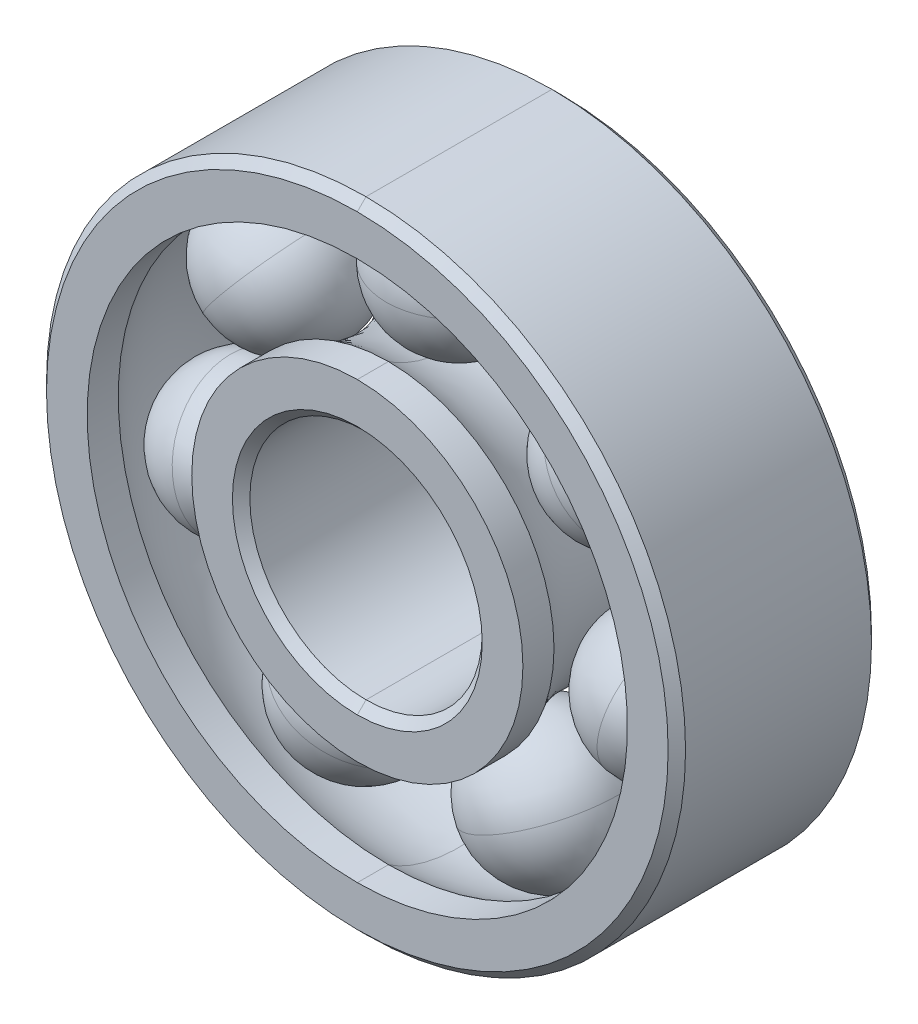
ISO-10303-21;
HEADER;
FILE_DESCRIPTION(('STEP AP214'),'2;1');
FILE_NAME('part.step','',(''),(''),'','','');
FILE_SCHEMA(('AUTOMOTIVE_DESIGN { 1 0 10303 214 1 1 1 1 }'));
ENDSEC;
DATA;
#1=APPLICATION_CONTEXT('core data for automotive mechanical design processes');
#2=APPLICATION_PROTOCOL_DEFINITION('international standard','automotive_design',2000,#1);
#3=PRODUCT_CONTEXT('',#1,'mechanical');
#4=PRODUCT('Part','Part','',(#3));
#5=PRODUCT_RELATED_PRODUCT_CATEGORY('part','',(#4));
#6=PRODUCT_DEFINITION_FORMATION('','',#4);
#7=PRODUCT_DEFINITION_CONTEXT('part definition',#1,'design');
#8=PRODUCT_DEFINITION('design','',#6,#7);
#9=PRODUCT_DEFINITION_SHAPE('','',#8);
#10=(LENGTH_UNIT() NAMED_UNIT(*) SI_UNIT(.MILLI.,.METRE.));
#11=(NAMED_UNIT(*) PLANE_ANGLE_UNIT() SI_UNIT($,.RADIAN.));
#12=(NAMED_UNIT(*) SI_UNIT($,.STERADIAN.) SOLID_ANGLE_UNIT());
#13=UNCERTAINTY_MEASURE_WITH_UNIT(LENGTH_MEASURE(1.E-05),#10,'distance_accuracy_value','');
#14=(GEOMETRIC_REPRESENTATION_CONTEXT(3) GLOBAL_UNCERTAINTY_ASSIGNED_CONTEXT((#13)) GLOBAL_UNIT_ASSIGNED_CONTEXT((#10,
#11,#12)) REPRESENTATION_CONTEXT('',''));
#15=CARTESIAN_POINT('',(0.,0.,0.));
#16=DIRECTION('',(0.,0.,1.));
#17=DIRECTION('',(1.,0.,0.));
#18=AXIS2_PLACEMENT_3D('',#15,#16,#17);
#19=CARTESIAN_POINT('',(-5.86373611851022,4.6761735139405,0.));
#20=DIRECTION('',(-0.78183148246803,0.623489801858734,0.));
#21=DIRECTION('',(0.623489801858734,0.78183148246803,0.));
#22=AXIS2_PLACEMENT_3D('',#19,#20,#21);
#23=SPHERICAL_SURFACE('',#22,2.5);
#24=CARTESIAN_POINT('',(-5.86373611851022,4.6761735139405,0.));
#25=DIRECTION('',(-0.78183148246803,0.623489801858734,0.));
#26=DIRECTION('',(-0.623489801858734,-0.78183148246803,0.));
#27=AXIS2_PLACEMENT_3D('',#24,#25,#26);
#28=CIRCLE('',#27,2.5);
#29=CARTESIAN_POINT('',(-5.86373611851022,4.6761735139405,-2.5));
#30=VERTEX_POINT('',#29);
#31=CARTESIAN_POINT('',(-5.86373611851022,4.6761735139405,2.5));
#32=VERTEX_POINT('',#31);
#33=EDGE_CURVE('P0_E11',#30,#32,#28,.T.);
#34=ORIENTED_EDGE('',*,*,#33,.F.);
#35=CARTESIAN_POINT('',(-5.86373611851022,4.6761735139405,0.));
#36=DIRECTION('',(0.78183148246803,-0.623489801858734,0.));
#37=DIRECTION('',(0.623489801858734,0.78183148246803,0.));
#38=AXIS2_PLACEMENT_3D('',#35,#36,#37);
#39=CIRCLE('',#38,2.5);
#40=EDGE_CURVE('P0_E20',#30,#32,#39,.T.);
#41=ORIENTED_EDGE('',*,*,#40,.T.);
#42=EDGE_LOOP('',(#34,#41));
#43=FACE_BOUND('',#42,.T.);
#44=ADVANCED_FACE('P0_F16',(#43),#23,.T.);
#45=CARTESIAN_POINT('',(-5.86373611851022,4.6761735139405,0.));
#46=DIRECTION('',(-0.78183148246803,0.623489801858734,0.));
#47=DIRECTION('',(0.623489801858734,0.78183148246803,0.));
#48=AXIS2_PLACEMENT_3D('',#45,#46,#47);
#49=SPHERICAL_SURFACE('',#48,2.5);
#50=ORIENTED_EDGE('',*,*,#40,.F.);
#51=ORIENTED_EDGE('',*,*,#33,.T.);
#52=EDGE_LOOP('',(#50,#51));
#53=FACE_BOUND('',#52,.T.);
#54=ADVANCED_FACE('P0_F18',(#53),#49,.T.);
#55=CLOSED_SHELL('',(#44,#54));
#56=MANIFOLD_SOLID_BREP('P0_B1',#55);
#57=CARTESIAN_POINT('',(3.25412804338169,-6.75726650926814,0.));
#58=DIRECTION('',(0.433883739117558,-0.900968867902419,0.));
#59=DIRECTION('',(-0.900968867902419,-0.433883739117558,0.));
#60=AXIS2_PLACEMENT_3D('',#57,#58,#59);
#61=SPHERICAL_SURFACE('',#60,2.5);
#62=CARTESIAN_POINT('',(3.25412804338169,-6.75726650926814,0.));
#63=DIRECTION('',(0.433883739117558,-0.900968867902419,0.));
#64=DIRECTION('',(0.900968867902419,0.433883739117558,0.));
#65=AXIS2_PLACEMENT_3D('',#62,#63,#64);
#66=CIRCLE('',#65,2.5);
#67=CARTESIAN_POINT('',(3.25412804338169,-6.75726650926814,-2.5));
#68=VERTEX_POINT('',#67);
#69=CARTESIAN_POINT('',(3.25412804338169,-6.75726650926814,2.5));
#70=VERTEX_POINT('',#69);
#71=EDGE_CURVE('P1_E11',#68,#70,#66,.T.);
#72=ORIENTED_EDGE('',*,*,#71,.F.);
#73=CARTESIAN_POINT('',(3.25412804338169,-6.75726650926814,0.));
#74=DIRECTION('',(-0.433883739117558,0.900968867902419,0.));
#75=DIRECTION('',(-0.900968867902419,-0.433883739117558,0.));
#76=AXIS2_PLACEMENT_3D('',#73,#74,#75);
#77=CIRCLE('',#76,2.5);
#78=EDGE_CURVE('P1_E19',#68,#70,#77,.T.);
#79=ORIENTED_EDGE('',*,*,#78,.T.);
#80=EDGE_LOOP('',(#72,#79));
#81=FACE_BOUND('',#80,.T.);
#82=ADVANCED_FACE('P1_F16',(#81),#61,.T.);
#83=CARTESIAN_POINT('',(3.25412804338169,-6.75726650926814,0.));
#84=DIRECTION('',(0.433883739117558,-0.900968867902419,0.));
#85=DIRECTION('',(-0.900968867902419,-0.433883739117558,0.));
#86=AXIS2_PLACEMENT_3D('',#83,#84,#85);
#87=SPHERICAL_SURFACE('',#86,2.5);
#88=ORIENTED_EDGE('',*,*,#78,.F.);
#89=ORIENTED_EDGE('',*,*,#71,.T.);
#90=EDGE_LOOP('',(#88,#89));
#91=FACE_BOUND('',#90,.T.);
#92=ADVANCED_FACE('P1_F40',(#91),#87,.T.);
#93=CLOSED_SHELL('',(#82,#92));
#94=MANIFOLD_SOLID_BREP('P1_B1',#93);
#95=CARTESIAN_POINT('',(0.,7.5,0.));
#96=DIRECTION('',(0.,1.,0.));
#97=DIRECTION('',(1.,0.,0.));
#98=AXIS2_PLACEMENT_3D('',#95,#96,#97);
#99=SPHERICAL_SURFACE('',#98,2.5);
#100=CARTESIAN_POINT('',(0.,7.5,0.));
#101=DIRECTION('',(0.,1.,0.));
#102=DIRECTION('',(-1.,0.,0.));
#103=AXIS2_PLACEMENT_3D('',#100,#101,#102);
#104=CIRCLE('',#103,2.5);
#105=CARTESIAN_POINT('',(0.,7.5,-2.5));
#106=VERTEX_POINT('',#105);
#107=CARTESIAN_POINT('',(0.,7.5,2.5));
#108=VERTEX_POINT('',#107);
#109=EDGE_CURVE('P2_E11',#106,#108,#104,.T.);
#110=ORIENTED_EDGE('',*,*,#109,.F.);
#111=CARTESIAN_POINT('',(0.,7.5,0.));
#112=DIRECTION('',(0.,-1.,0.));
#113=DIRECTION('',(0.,0.,-1.));
#114=AXIS2_PLACEMENT_3D('',#111,#112,#113);
#115=CIRCLE('',#114,2.5);
#116=EDGE_CURVE('P2_E19',#106,#108,#115,.T.);
#117=ORIENTED_EDGE('',*,*,#116,.T.);
#118=EDGE_LOOP('',(#110,#117));
#119=FACE_BOUND('',#118,.T.);
#120=ADVANCED_FACE('P2_F16',(#119),#99,.T.);
#121=CARTESIAN_POINT('',(0.,7.5,0.));
#122=DIRECTION('',(0.,1.,0.));
#123=DIRECTION('',(1.,0.,0.));
#124=AXIS2_PLACEMENT_3D('',#121,#122,#123);
#125=SPHERICAL_SURFACE('',#124,2.5);
#126=ORIENTED_EDGE('',*,*,#116,.F.);
#127=ORIENTED_EDGE('',*,*,#109,.T.);
#128=EDGE_LOOP('',(#126,#127));
#129=FACE_BOUND('',#128,.T.);
#130=ADVANCED_FACE('P2_F40',(#129),#125,.T.);
#131=CLOSED_SHELL('',(#120,#130));
#132=MANIFOLD_SOLID_BREP('P2_B1',#131);
#133=CARTESIAN_POINT('',(0.,0.,2.96445461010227));
#134=DIRECTION('',(0.,0.,1.));
#135=DIRECTION('',(0.,1.,0.));
#136=AXIS2_PLACEMENT_3D('',#133,#134,#135);
#137=CYLINDRICAL_SURFACE('',#136,9.3);
#138=DIRECTION('',(0.,0.,1.));
#139=VECTOR('',#138,1.);
#140=CARTESIAN_POINT('',(0.,-9.3,2.96445461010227));
#141=LINE('',#140,#139);
#142=CARTESIAN_POINT('',(0.,-9.3,2.42890922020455));
#143=VERTEX_POINT('',#142);
#144=CARTESIAN_POINT('',(0.,-9.3,3.5));
#145=VERTEX_POINT('',#144);
#146=EDGE_CURVE('P3_E149',#143,#145,#141,.T.);
#147=ORIENTED_EDGE('',*,*,#146,.F.);
#148=CARTESIAN_POINT('',(0.,0.,2.42890922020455));
#149=DIRECTION('',(0.,0.,-1.));
#150=DIRECTION('',(1.,0.,0.));
#151=AXIS2_PLACEMENT_3D('',#148,#149,#150);
#152=CIRCLE('',#151,9.3);
#153=CARTESIAN_POINT('',(0.,9.3,2.42890922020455));
#154=VERTEX_POINT('',#153);
#155=EDGE_CURVE('P3_E180',#143,#154,#152,.T.);
#156=ORIENTED_EDGE('',*,*,#155,.T.);
#157=DIRECTION('',(0.,0.,1.));
#158=VECTOR('',#157,1.);
#159=CARTESIAN_POINT('',(0.,9.3,2.96445461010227));
#160=LINE('',#159,#158);
#161=CARTESIAN_POINT('',(0.,9.3,3.5));
#162=VERTEX_POINT('',#161);
#163=EDGE_CURVE('P3_E20',#154,#162,#160,.T.);
#164=ORIENTED_EDGE('',*,*,#163,.T.);
#165=CARTESIAN_POINT('',(0.,0.,3.5));
#166=DIRECTION('',(0.,0.,-1.));
#167=DIRECTION('',(1.,0.,0.));
#168=AXIS2_PLACEMENT_3D('',#165,#166,#167);
#169=CIRCLE('',#168,9.3);
#170=EDGE_CURVE('P3_E11',#145,#162,#169,.T.);
#171=ORIENTED_EDGE('',*,*,#170,.F.);
#172=EDGE_LOOP('',(#147,#156,#164,#171));
#173=FACE_BOUND('',#172,.T.);
#174=ADVANCED_FACE('P3_F16',(#173),#137,.F.);
#175=CARTESIAN_POINT('',(0.,9.3,2.42890922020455));
#176=CARTESIAN_POINT('',(18.6,9.29999999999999,2.42890922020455));
#177=CARTESIAN_POINT('',(18.6,-9.29999999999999,2.42890922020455));
#178=CARTESIAN_POINT('',(0.,-9.3,2.42890922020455));
#179=CARTESIAN_POINT('',(0.,10.2868852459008,0.995454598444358));
#180=CARTESIAN_POINT('',(20.5737704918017,10.2868852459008,0.995454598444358));
#181=CARTESIAN_POINT('',(20.5737704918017,-10.2868852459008,0.995454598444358));
#182=CARTESIAN_POINT('',(0.,-10.2868852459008,0.995454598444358));
#183=CARTESIAN_POINT('',(0.,10.2868852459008,-0.995454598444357));
#184=CARTESIAN_POINT('',(20.5737704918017,10.2868852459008,-0.995454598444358));
#185=CARTESIAN_POINT('',(20.5737704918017,-10.2868852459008,-0.995454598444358));
#186=CARTESIAN_POINT('',(0.,-10.2868852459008,-0.995454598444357));
#187=CARTESIAN_POINT('',(0.,9.3,-2.42890922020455));
#188=CARTESIAN_POINT('',(18.6,9.29999999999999,-2.42890922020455));
#189=CARTESIAN_POINT('',(18.6,-9.29999999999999,-2.42890922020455));
#190=CARTESIAN_POINT('',(0.,-9.3,-2.42890922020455));
#191=(BOUNDED_SURFACE() B_SPLINE_SURFACE(3,3,((#175,#176,#177,#178),(#179,#180,#181,#182),(#183,
#184,#185,#186),(#187,#188,#189,#190)),.UNSPECIFIED.,.F.,.F.,
.F.) B_SPLINE_SURFACE_WITH_KNOTS((4,4),(4,4),(0.,1.),(0.,1.),
.UNSPECIFIED.) GEOMETRIC_REPRESENTATION_ITEM() RATIONAL_B_SPLINE_SURFACE(((1.,0.333333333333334,
0.333333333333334,1.),(0.813333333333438,0.271111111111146,0.271111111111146,0.813333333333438),
(0.813333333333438,0.271111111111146,0.271111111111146,0.813333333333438),(1.,0.333333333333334,
0.333333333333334,1.))) REPRESENTATION_ITEM('') SURFACE());
#192=CARTESIAN_POINT('',(0.,-9.3,2.42890922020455));
#193=CARTESIAN_POINT('',(0.,-10.2868852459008,0.995454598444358));
#194=CARTESIAN_POINT('',(0.,-10.2868852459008,-0.995454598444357));
#195=CARTESIAN_POINT('',(0.,-9.3,-2.42890922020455));
#196=(BOUNDED_CURVE() B_SPLINE_CURVE(3,(#192,#193,#194,#195),.UNSPECIFIED.,.F.,
.F.) B_SPLINE_CURVE_WITH_KNOTS((4,4),(0.803802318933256,2.33779033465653),
.UNSPECIFIED.) CURVE() GEOMETRIC_REPRESENTATION_ITEM() RATIONAL_B_SPLINE_CURVE((1.,
0.813333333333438,0.813333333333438,1.)) REPRESENTATION_ITEM(''));
#197=CARTESIAN_POINT('',(0.,-9.3,-2.42890922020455));
#198=VERTEX_POINT('',#197);
#199=EDGE_CURVE('P3_E183',#143,#198,#196,.T.);
#200=CARTESIAN_POINT('',(0.,0.,2.42890922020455));
#201=DIRECTION('',(0.,0.,-1.));
#202=DIRECTION('',(1.,0.,0.));
#203=AXIS2_PLACEMENT_3D('',#200,#201,#202);
#204=CIRCLE('',#203,9.3);
#205=EDGE_CURVE('P3_E146',#154,#143,#204,.T.);
#206=CARTESIAN_POINT('',(0.,9.3,2.42890922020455));
#207=CARTESIAN_POINT('',(0.,10.2868852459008,0.995454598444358));
#208=CARTESIAN_POINT('',(0.,10.2868852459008,-0.995454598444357));
#209=CARTESIAN_POINT('',(0.,9.3,-2.42890922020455));
#210=(BOUNDED_CURVE() B_SPLINE_CURVE(3,(#206,#207,#208,#209),.UNSPECIFIED.,.F.,
.F.) B_SPLINE_CURVE_WITH_KNOTS((4,4),(0.803802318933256,2.33779033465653),
.UNSPECIFIED.) CURVE() GEOMETRIC_REPRESENTATION_ITEM() RATIONAL_B_SPLINE_CURVE((1.,
0.813333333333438,0.813333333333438,1.)) REPRESENTATION_ITEM(''));
#211=CARTESIAN_POINT('',(0.,9.3,-2.42890922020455));
#212=VERTEX_POINT('',#211);
#213=EDGE_CURVE('P3_E150',#154,#212,#210,.T.);
#214=CARTESIAN_POINT('',(0.,0.,-2.42890922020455));
#215=DIRECTION('',(0.,0.,-1.));
#216=DIRECTION('',(1.,0.,0.));
#217=AXIS2_PLACEMENT_3D('',#214,#215,#216);
#218=CIRCLE('',#217,9.3);
#219=EDGE_CURVE('P3_E179',#212,#198,#218,.T.);
#220=ORIENTED_EDGE('',*,*,#199,.F.);
#221=ORIENTED_EDGE('',*,*,#205,.F.);
#222=ORIENTED_EDGE('',*,*,#213,.T.);
#223=ORIENTED_EDGE('',*,*,#219,.T.);
#224=EDGE_LOOP('',(#220,#221,#222,#223));
#225=FACE_BOUND('',#224,.T.);
#226=ADVANCED_FACE('P3_F254',(#225),#191,.T.);
#227=CARTESIAN_POINT('',(0.,11.,3.5));
#228=DIRECTION('',(0.,0.,1.));
#229=DIRECTION('',(1.,0.,0.));
#230=AXIS2_PLACEMENT_3D('',#227,#228,#229);
#231=PLANE('',#230);
#232=CARTESIAN_POINT('',(0.,0.,3.5));
#233=DIRECTION('',(0.,0.,-1.));
#234=DIRECTION('',(1.,0.,0.));
#235=AXIS2_PLACEMENT_3D('',#232,#233,#234);
#236=CIRCLE('',#235,9.3);
#237=EDGE_CURVE('P3_E170',#162,#145,#236,.T.);
#238=ORIENTED_EDGE('',*,*,#237,.T.);
#239=ORIENTED_EDGE('',*,*,#170,.T.);
#240=EDGE_LOOP('',(#238,#239));
#241=FACE_BOUND('',#240,.T.);
#242=CARTESIAN_POINT('',(0.,0.,3.5));
#243=DIRECTION('',(0.,0.,-1.));
#244=DIRECTION('',(0.,-1.,0.));
#245=AXIS2_PLACEMENT_3D('',#242,#243,#244);
#246=CIRCLE('',#245,10.7);
#247=CARTESIAN_POINT('',(0.,-10.7,3.5));
#248=VERTEX_POINT('',#247);
#249=CARTESIAN_POINT('',(0.,10.7,3.5));
#250=VERTEX_POINT('',#249);
#251=EDGE_CURVE('P3_E132',#248,#250,#246,.T.);
#252=ORIENTED_EDGE('',*,*,#251,.F.);
#253=CARTESIAN_POINT('',(0.,0.,3.5));
#254=DIRECTION('',(0.,0.,-1.));
#255=DIRECTION('',(0.,-1.,0.));
#256=AXIS2_PLACEMENT_3D('',#253,#254,#255);
#257=CIRCLE('',#256,10.7);
#258=EDGE_CURVE('P3_E27',#250,#248,#257,.T.);
#259=ORIENTED_EDGE('',*,*,#258,.F.);
#260=EDGE_LOOP('',(#252,#259));
#261=FACE_BOUND('',#260,.T.);
#262=ADVANCED_FACE('P3_F271',(#241,#261),#231,.T.);
#263=CARTESIAN_POINT('',(0.,0.,-2.96445461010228));
#264=DIRECTION('',(0.,0.,1.));
#265=DIRECTION('',(0.,1.,0.));
#266=AXIS2_PLACEMENT_3D('',#263,#264,#265);
#267=CYLINDRICAL_SURFACE('',#266,9.3);
#268=DIRECTION('',(0.,0.,1.));
#269=VECTOR('',#268,1.);
#270=CARTESIAN_POINT('',(0.,-9.3,-2.96445461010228));
#271=LINE('',#270,#269);
#272=CARTESIAN_POINT('',(0.,-9.3,-3.5));
#273=VERTEX_POINT('',#272);
#274=EDGE_CURVE('P3_E174',#273,#198,#271,.T.);
#275=ORIENTED_EDGE('',*,*,#274,.F.);
#276=CARTESIAN_POINT('',(0.,0.,-3.5));
#277=DIRECTION('',(0.,0.,-1.));
#278=DIRECTION('',(1.,0.,0.));
#279=AXIS2_PLACEMENT_3D('',#276,#277,#278);
#280=CIRCLE('',#279,9.3);
#281=CARTESIAN_POINT('',(0.,9.3,-3.5));
#282=VERTEX_POINT('',#281);
#283=EDGE_CURVE('P3_E110',#273,#282,#280,.T.);
#284=ORIENTED_EDGE('',*,*,#283,.T.);
#285=DIRECTION('',(0.,0.,1.));
#286=VECTOR('',#285,1.);
#287=CARTESIAN_POINT('',(0.,9.3,-2.96445461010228));
#288=LINE('',#287,#286);
#289=EDGE_CURVE('P3_E140',#282,#212,#288,.T.);
#290=ORIENTED_EDGE('',*,*,#289,.T.);
#291=CARTESIAN_POINT('',(0.,0.,-2.42890922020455));
#292=DIRECTION('',(0.,0.,-1.));
#293=DIRECTION('',(1.,0.,0.));
#294=AXIS2_PLACEMENT_3D('',#291,#292,#293);
#295=CIRCLE('',#294,9.3);
#296=EDGE_CURVE('P3_E195',#198,#212,#295,.T.);
#297=ORIENTED_EDGE('',*,*,#296,.F.);
#298=EDGE_LOOP('',(#275,#284,#290,#297));
#299=FACE_BOUND('',#298,.T.);
#300=ADVANCED_FACE('P3_F209',(#299),#267,.F.);
#301=CARTESIAN_POINT('',(0.,0.,3.35));
#302=DIRECTION('',(0.,0.,-1.));
#303=DIRECTION('',(0.,-1.,0.));
#304=AXIS2_PLACEMENT_3D('',#301,#302,#303);
#305=CONICAL_SURFACE('',#304,10.85,0.785398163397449);
#306=DIRECTION('',(0.,0.707106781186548,-0.707106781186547));
#307=VECTOR('',#306,1.);
#308=CARTESIAN_POINT('',(0.,10.85,3.35));
#309=LINE('',#308,#307);
#310=CARTESIAN_POINT('',(0.,11.,3.2));
#311=VERTEX_POINT('',#310);
#312=EDGE_CURVE('P3_E104',#250,#311,#309,.T.);
#313=ORIENTED_EDGE('',*,*,#312,.F.);
#314=ORIENTED_EDGE('',*,*,#258,.T.);
#315=DIRECTION('',(0.,-0.707106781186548,-0.707106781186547));
#316=VECTOR('',#315,1.);
#317=CARTESIAN_POINT('',(0.,-10.85,3.35));
#318=LINE('',#317,#316);
#319=CARTESIAN_POINT('',(0.,-11.,3.2));
#320=VERTEX_POINT('',#319);
#321=EDGE_CURVE('P3_E107',#248,#320,#318,.T.);
#322=ORIENTED_EDGE('',*,*,#321,.T.);
#323=CARTESIAN_POINT('',(0.,0.,3.2));
#324=DIRECTION('',(0.,0.,1.));
#325=DIRECTION('',(0.,-1.,0.));
#326=AXIS2_PLACEMENT_3D('',#323,#324,#325);
#327=CIRCLE('',#326,11.);
#328=EDGE_CURVE('P3_E94',#320,#311,#327,.T.);
#329=ORIENTED_EDGE('',*,*,#328,.T.);
#330=EDGE_LOOP('',(#313,#314,#322,#329));
#331=FACE_BOUND('',#330,.T.);
#332=ADVANCED_FACE('P3_F102',(#331),#305,.T.);
#333=CARTESIAN_POINT('',(0.,9.3,-3.5));
#334=DIRECTION('',(0.,0.,-1.));
#335=DIRECTION('',(0.,-1.,0.));
#336=AXIS2_PLACEMENT_3D('',#333,#334,#335);
#337=PLANE('',#336);
#338=CARTESIAN_POINT('',(0.,0.,-3.5));
#339=DIRECTION('',(0.,0.,-1.));
#340=DIRECTION('',(1.,0.,0.));
#341=AXIS2_PLACEMENT_3D('',#338,#339,#340);
#342=CIRCLE('',#341,9.3);
#343=EDGE_CURVE('P3_E172',#282,#273,#342,.T.);
#344=ORIENTED_EDGE('',*,*,#343,.F.);
#345=ORIENTED_EDGE('',*,*,#283,.F.);
#346=EDGE_LOOP('',(#344,#345));
#347=FACE_BOUND('',#346,.T.);
#348=CARTESIAN_POINT('',(0.,0.,-3.5));
#349=DIRECTION('',(0.,0.,1.));
#350=DIRECTION('',(0.,-1.,0.));
#351=AXIS2_PLACEMENT_3D('',#348,#349,#350);
#352=CIRCLE('',#351,10.7);
#353=CARTESIAN_POINT('',(0.,-10.7,-3.5));
#354=VERTEX_POINT('',#353);
#355=CARTESIAN_POINT('',(0.,10.7,-3.5));
#356=VERTEX_POINT('',#355);
#357=EDGE_CURVE('P3_E123',#354,#356,#352,.T.);
#358=ORIENTED_EDGE('',*,*,#357,.F.);
#359=CARTESIAN_POINT('',(0.,0.,-3.5));
#360=DIRECTION('',(0.,0.,1.));
#361=DIRECTION('',(0.,-1.,0.));
#362=AXIS2_PLACEMENT_3D('',#359,#360,#361);
#363=CIRCLE('',#362,10.7);
#364=EDGE_CURVE('P3_E41',#356,#354,#363,.T.);
#365=ORIENTED_EDGE('',*,*,#364,.F.);
#366=EDGE_LOOP('',(#358,#365));
#367=FACE_BOUND('',#366,.T.);
#368=ADVANCED_FACE('P3_F221',(#347,#367),#337,.T.);
#369=CARTESIAN_POINT('',(0.,0.,0.));
#370=DIRECTION('',(0.,0.,1.));
#371=DIRECTION('',(0.,1.,0.));
#372=AXIS2_PLACEMENT_3D('',#369,#370,#371);
#373=CYLINDRICAL_SURFACE('',#372,11.);
#374=DIRECTION('',(0.,0.,1.));
#375=VECTOR('',#374,1.);
#376=CARTESIAN_POINT('',(0.,-11.,0.));
#377=LINE('',#376,#375);
#378=CARTESIAN_POINT('',(0.,-11.,-3.2));
#379=VERTEX_POINT('',#378);
#380=EDGE_CURVE('P3_E124',#379,#320,#377,.T.);
#381=ORIENTED_EDGE('',*,*,#380,.F.);
#382=CARTESIAN_POINT('',(0.,0.,-3.2));
#383=DIRECTION('',(0.,0.,-1.));
#384=DIRECTION('',(0.,-1.,0.));
#385=AXIS2_PLACEMENT_3D('',#382,#383,#384);
#386=CIRCLE('',#385,11.);
#387=CARTESIAN_POINT('',(0.,11.,-3.2));
#388=VERTEX_POINT('',#387);
#389=EDGE_CURVE('P3_E117',#388,#379,#386,.T.);
#390=ORIENTED_EDGE('',*,*,#389,.F.);
#391=DIRECTION('',(0.,0.,1.));
#392=VECTOR('',#391,1.);
#393=CARTESIAN_POINT('',(0.,11.,0.));
#394=LINE('',#393,#392);
#395=EDGE_CURVE('P3_E113',#388,#311,#394,.T.);
#396=ORIENTED_EDGE('',*,*,#395,.T.);
#397=ORIENTED_EDGE('',*,*,#328,.F.);
#398=EDGE_LOOP('',(#381,#390,#396,#397));
#399=FACE_BOUND('',#398,.T.);
#400=ADVANCED_FACE('P3_F115',(#399),#373,.T.);
#401=CARTESIAN_POINT('',(0.,0.,-3.35));
#402=DIRECTION('',(0.,0.,1.));
#403=DIRECTION('',(0.,-1.,0.));
#404=AXIS2_PLACEMENT_3D('',#401,#402,#403);
#405=CONICAL_SURFACE('',#404,10.85,0.785398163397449);
#406=DIRECTION('',(0.,0.707106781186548,0.707106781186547));
#407=VECTOR('',#406,1.);
#408=CARTESIAN_POINT('',(0.,10.85,-3.35));
#409=LINE('',#408,#407);
#410=EDGE_CURVE('P3_E153',#356,#388,#409,.T.);
#411=ORIENTED_EDGE('',*,*,#410,.F.);
#412=ORIENTED_EDGE('',*,*,#364,.T.);
#413=DIRECTION('',(0.,-0.707106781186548,0.707106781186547));
#414=VECTOR('',#413,1.);
#415=CARTESIAN_POINT('',(0.,-10.85,-3.35));
#416=LINE('',#415,#414);
#417=EDGE_CURVE('P3_E152',#354,#379,#416,.T.);
#418=ORIENTED_EDGE('',*,*,#417,.T.);
#419=CARTESIAN_POINT('',(0.,0.,-3.2));
#420=DIRECTION('',(0.,0.,-1.));
#421=DIRECTION('',(0.,-1.,0.));
#422=AXIS2_PLACEMENT_3D('',#419,#420,#421);
#423=CIRCLE('',#422,11.);
#424=EDGE_CURVE('P3_E227',#379,#388,#423,.T.);
#425=ORIENTED_EDGE('',*,*,#424,.T.);
#426=EDGE_LOOP('',(#411,#412,#418,#425));
#427=FACE_BOUND('',#426,.T.);
#428=ADVANCED_FACE('P3_F226',(#427),#405,.T.);
#429=CARTESIAN_POINT('',(0.,0.,-3.35));
#430=DIRECTION('',(0.,0.,1.));
#431=DIRECTION('',(0.,-1.,0.));
#432=AXIS2_PLACEMENT_3D('',#429,#430,#431);
#433=CONICAL_SURFACE('',#432,10.85,0.785398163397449);
#434=ORIENTED_EDGE('',*,*,#357,.T.);
#435=ORIENTED_EDGE('',*,*,#410,.T.);
#436=ORIENTED_EDGE('',*,*,#389,.T.);
#437=ORIENTED_EDGE('',*,*,#417,.F.);
#438=EDGE_LOOP('',(#434,#435,#436,#437));
#439=FACE_BOUND('',#438,.T.);
#440=ADVANCED_FACE('P3_F224',(#439),#433,.T.);
#441=CARTESIAN_POINT('',(0.,0.,0.));
#442=DIRECTION('',(0.,0.,1.));
#443=DIRECTION('',(0.,1.,0.));
#444=AXIS2_PLACEMENT_3D('',#441,#442,#443);
#445=CYLINDRICAL_SURFACE('',#444,11.);
#446=ORIENTED_EDGE('',*,*,#424,.F.);
#447=ORIENTED_EDGE('',*,*,#380,.T.);
#448=CARTESIAN_POINT('',(0.,0.,3.2));
#449=DIRECTION('',(0.,0.,1.));
#450=DIRECTION('',(0.,-1.,0.));
#451=AXIS2_PLACEMENT_3D('',#448,#449,#450);
#452=CIRCLE('',#451,11.);
#453=EDGE_CURVE('P3_E126',#311,#320,#452,.T.);
#454=ORIENTED_EDGE('',*,*,#453,.F.);
#455=ORIENTED_EDGE('',*,*,#395,.F.);
#456=EDGE_LOOP('',(#446,#447,#454,#455));
#457=FACE_BOUND('',#456,.T.);
#458=ADVANCED_FACE('P3_F127',(#457),#445,.T.);
#459=CARTESIAN_POINT('',(0.,0.,3.35));
#460=DIRECTION('',(0.,0.,-1.));
#461=DIRECTION('',(0.,-1.,0.));
#462=AXIS2_PLACEMENT_3D('',#459,#460,#461);
#463=CONICAL_SURFACE('',#462,10.85,0.785398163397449);
#464=ORIENTED_EDGE('',*,*,#251,.T.);
#465=ORIENTED_EDGE('',*,*,#312,.T.);
#466=ORIENTED_EDGE('',*,*,#453,.T.);
#467=ORIENTED_EDGE('',*,*,#321,.F.);
#468=EDGE_LOOP('',(#464,#465,#466,#467));
#469=FACE_BOUND('',#468,.T.);
#470=ADVANCED_FACE('P3_F18',(#469),#463,.T.);
#471=CARTESIAN_POINT('',(0.,0.,-2.96445461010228));
#472=DIRECTION('',(0.,0.,1.));
#473=DIRECTION('',(0.,1.,0.));
#474=AXIS2_PLACEMENT_3D('',#471,#472,#473);
#475=CYLINDRICAL_SURFACE('',#474,9.3);
#476=ORIENTED_EDGE('',*,*,#343,.T.);
#477=ORIENTED_EDGE('',*,*,#274,.T.);
#478=ORIENTED_EDGE('',*,*,#219,.F.);
#479=ORIENTED_EDGE('',*,*,#289,.F.);
#480=EDGE_LOOP('',(#476,#477,#478,#479));
#481=FACE_BOUND('',#480,.T.);
#482=ADVANCED_FACE('P3_F217',(#481),#475,.F.);
#483=CARTESIAN_POINT('',(0.,0.,2.96445461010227));
#484=DIRECTION('',(0.,0.,1.));
#485=DIRECTION('',(0.,1.,0.));
#486=AXIS2_PLACEMENT_3D('',#483,#484,#485);
#487=CYLINDRICAL_SURFACE('',#486,9.3);
#488=ORIENTED_EDGE('',*,*,#205,.T.);
#489=ORIENTED_EDGE('',*,*,#146,.T.);
#490=ORIENTED_EDGE('',*,*,#237,.F.);
#491=ORIENTED_EDGE('',*,*,#163,.F.);
#492=EDGE_LOOP('',(#488,#489,#490,#491));
#493=FACE_BOUND('',#492,.T.);
#494=ADVANCED_FACE('P3_F264',(#493),#487,.F.);
#495=CARTESIAN_POINT('',(0.,-9.3,2.42890922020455));
#496=CARTESIAN_POINT('',(-18.6,-9.29999999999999,2.42890922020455));
#497=CARTESIAN_POINT('',(-18.6,9.29999999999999,2.42890922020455));
#498=CARTESIAN_POINT('',(0.,9.3,2.42890922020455));
#499=CARTESIAN_POINT('',(0.,-10.2868852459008,0.995454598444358));
#500=CARTESIAN_POINT('',(-20.5737704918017,-10.2868852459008,0.995454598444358));
#501=CARTESIAN_POINT('',(-20.5737704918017,10.2868852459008,0.995454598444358));
#502=CARTESIAN_POINT('',(0.,10.2868852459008,0.995454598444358));
#503=CARTESIAN_POINT('',(0.,-10.2868852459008,-0.995454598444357));
#504=CARTESIAN_POINT('',(-20.5737704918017,-10.2868852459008,-0.995454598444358));
#505=CARTESIAN_POINT('',(-20.5737704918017,10.2868852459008,-0.995454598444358));
#506=CARTESIAN_POINT('',(0.,10.2868852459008,-0.995454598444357));
#507=CARTESIAN_POINT('',(0.,-9.3,-2.42890922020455));
#508=CARTESIAN_POINT('',(-18.6,-9.29999999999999,-2.42890922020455));
#509=CARTESIAN_POINT('',(-18.6,9.29999999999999,-2.42890922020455));
#510=CARTESIAN_POINT('',(0.,9.3,-2.42890922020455));
#511=(BOUNDED_SURFACE() B_SPLINE_SURFACE(3,3,((#495,#496,#497,#498),(#499,#500,#501,#502),(#503,
#504,#505,#506),(#507,#508,#509,#510)),.UNSPECIFIED.,.F.,.F.,
.F.) B_SPLINE_SURFACE_WITH_KNOTS((4,4),(4,4),(0.,1.),(0.,1.),
.UNSPECIFIED.) GEOMETRIC_REPRESENTATION_ITEM() RATIONAL_B_SPLINE_SURFACE(((1.,0.333333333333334,
0.333333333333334,1.),(0.813333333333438,0.271111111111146,0.271111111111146,0.813333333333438),
(0.813333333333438,0.271111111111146,0.271111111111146,0.813333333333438),(1.,0.333333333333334,
0.333333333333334,1.))) REPRESENTATION_ITEM('') SURFACE());
#512=ORIENTED_EDGE('',*,*,#155,.F.);
#513=ORIENTED_EDGE('',*,*,#199,.T.);
#514=ORIENTED_EDGE('',*,*,#296,.T.);
#515=ORIENTED_EDGE('',*,*,#213,.F.);
#516=EDGE_LOOP('',(#512,#513,#514,#515));
#517=FACE_BOUND('',#516,.T.);
#518=ADVANCED_FACE('P3_F257',(#517),#511,.T.);
#519=CLOSED_SHELL('',(#174,#226,#262,#300,#332,#368,#400,#428,#440,#458,#470,#482,#494,#518));
#520=MANIFOLD_SOLID_BREP('P3_B1',#519);
#521=CARTESIAN_POINT('',(5.86373611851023,4.6761735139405,0.));
#522=DIRECTION('',(0.78183148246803,0.623489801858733,0.));
#523=DIRECTION('',(0.623489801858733,-0.78183148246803,0.));
#524=AXIS2_PLACEMENT_3D('',#521,#522,#523);
#525=SPHERICAL_SURFACE('',#524,2.5);
#526=CARTESIAN_POINT('',(5.86373611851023,4.6761735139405,0.));
#527=DIRECTION('',(0.78183148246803,0.623489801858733,0.));
#528=DIRECTION('',(-0.623489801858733,0.78183148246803,0.));
#529=AXIS2_PLACEMENT_3D('',#526,#527,#528);
#530=CIRCLE('',#529,2.5);
#531=CARTESIAN_POINT('',(5.86373611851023,4.6761735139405,-2.5));
#532=VERTEX_POINT('',#531);
#533=CARTESIAN_POINT('',(5.86373611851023,4.6761735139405,2.5));
#534=VERTEX_POINT('',#533);
#535=EDGE_CURVE('P4_E11',#532,#534,#530,.T.);
#536=ORIENTED_EDGE('',*,*,#535,.F.);
#537=CARTESIAN_POINT('',(5.86373611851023,4.6761735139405,0.));
#538=DIRECTION('',(-0.78183148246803,-0.623489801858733,0.));
#539=DIRECTION('',(0.623489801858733,-0.78183148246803,0.));
#540=AXIS2_PLACEMENT_3D('',#537,#538,#539);
#541=CIRCLE('',#540,2.5);
#542=EDGE_CURVE('P4_E20',#532,#534,#541,.T.);
#543=ORIENTED_EDGE('',*,*,#542,.T.);
#544=EDGE_LOOP('',(#536,#543));
#545=FACE_BOUND('',#544,.T.);
#546=ADVANCED_FACE('P4_F16',(#545),#525,.T.);
#547=CARTESIAN_POINT('',(5.86373611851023,4.6761735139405,0.));
#548=DIRECTION('',(0.78183148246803,0.623489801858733,0.));
#549=DIRECTION('',(0.623489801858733,-0.78183148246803,0.));
#550=AXIS2_PLACEMENT_3D('',#547,#548,#549);
#551=SPHERICAL_SURFACE('',#550,2.5);
#552=ORIENTED_EDGE('',*,*,#542,.F.);
#553=ORIENTED_EDGE('',*,*,#535,.T.);
#554=EDGE_LOOP('',(#552,#553));
#555=FACE_BOUND('',#554,.T.);
#556=ADVANCED_FACE('P4_F18',(#555),#551,.T.);
#557=CLOSED_SHELL('',(#546,#556));
#558=MANIFOLD_SOLID_BREP('P4_B1',#557);
#559=CARTESIAN_POINT('',(0.,0.,2.96445461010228));
#560=DIRECTION('',(0.,0.,1.));
#561=DIRECTION('',(0.,1.,0.));
#562=AXIS2_PLACEMENT_3D('',#559,#560,#561);
#563=CYLINDRICAL_SURFACE('',#562,5.7);
#564=DIRECTION('',(0.,0.,1.));
#565=VECTOR('',#564,1.);
#566=CARTESIAN_POINT('',(0.,-5.7,2.96445461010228));
#567=LINE('',#566,#565);
#568=CARTESIAN_POINT('',(0.,-5.7,2.42890922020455));
#569=VERTEX_POINT('',#568);
#570=CARTESIAN_POINT('',(0.,-5.7,3.5));
#571=VERTEX_POINT('',#570);
#572=EDGE_CURVE('P5_E158',#569,#571,#567,.T.);
#573=ORIENTED_EDGE('',*,*,#572,.F.);
#574=CARTESIAN_POINT('',(0.,0.,2.42890922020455));
#575=DIRECTION('',(0.,0.,-1.));
#576=DIRECTION('',(1.,0.,0.));
#577=AXIS2_PLACEMENT_3D('',#574,#575,#576);
#578=CIRCLE('',#577,5.7);
#579=CARTESIAN_POINT('',(0.,5.7,2.42890922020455));
#580=VERTEX_POINT('',#579);
#581=EDGE_CURVE('P5_E28',#580,#569,#578,.T.);
#582=ORIENTED_EDGE('',*,*,#581,.F.);
#583=DIRECTION('',(0.,0.,1.));
#584=VECTOR('',#583,1.);
#585=CARTESIAN_POINT('',(0.,5.7,2.96445461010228));
#586=LINE('',#585,#584);
#587=CARTESIAN_POINT('',(0.,5.7,3.5));
#588=VERTEX_POINT('',#587);
#589=EDGE_CURVE('P5_E120',#580,#588,#586,.T.);
#590=ORIENTED_EDGE('',*,*,#589,.T.);
#591=CARTESIAN_POINT('',(0.,0.,3.5));
#592=DIRECTION('',(0.,0.,-1.));
#593=DIRECTION('',(1.,0.,0.));
#594=AXIS2_PLACEMENT_3D('',#591,#592,#593);
#595=CIRCLE('',#594,5.7);
#596=EDGE_CURVE('P5_E11',#588,#571,#595,.T.);
#597=ORIENTED_EDGE('',*,*,#596,.T.);
#598=EDGE_LOOP('',(#573,#582,#590,#597));
#599=FACE_BOUND('',#598,.T.);
#600=ADVANCED_FACE('P5_F16',(#599),#563,.T.);
#601=CARTESIAN_POINT('',(0.,5.7,3.5));
#602=DIRECTION('',(0.,0.,1.));
#603=DIRECTION('',(1.,0.,0.));
#604=AXIS2_PLACEMENT_3D('',#601,#602,#603);
#605=PLANE('',#604);
#606=CARTESIAN_POINT('',(0.,0.,3.5));
#607=DIRECTION('',(0.,0.,1.));
#608=DIRECTION('',(0.,-1.,0.));
#609=AXIS2_PLACEMENT_3D('',#606,#607,#608);
#610=CIRCLE('',#609,4.3);
#611=CARTESIAN_POINT('',(0.,-4.3,3.5));
#612=VERTEX_POINT('',#611);
#613=CARTESIAN_POINT('',(0.,4.3,3.5));
#614=VERTEX_POINT('',#613);
#615=EDGE_CURVE('P5_E90',#612,#614,#610,.T.);
#616=ORIENTED_EDGE('',*,*,#615,.F.);
#617=CARTESIAN_POINT('',(0.,0.,3.5));
#618=DIRECTION('',(0.,0.,1.));
#619=DIRECTION('',(0.,-1.,0.));
#620=AXIS2_PLACEMENT_3D('',#617,#618,#619);
#621=CIRCLE('',#620,4.3);
#622=EDGE_CURVE('P5_E104',#614,#612,#621,.T.);
#623=ORIENTED_EDGE('',*,*,#622,.F.);
#624=EDGE_LOOP('',(#616,#623));
#625=FACE_BOUND('',#624,.T.);
#626=ORIENTED_EDGE('',*,*,#596,.F.);
#627=CARTESIAN_POINT('',(0.,0.,3.5));
#628=DIRECTION('',(0.,0.,-1.));
#629=DIRECTION('',(1.,0.,0.));
#630=AXIS2_PLACEMENT_3D('',#627,#628,#629);
#631=CIRCLE('',#630,5.7);
#632=EDGE_CURVE('P5_E184',#571,#588,#631,.T.);
#633=ORIENTED_EDGE('',*,*,#632,.F.);
#634=EDGE_LOOP('',(#626,#633));
#635=FACE_BOUND('',#634,.T.);
#636=ADVANCED_FACE('P5_F105',(#625,#635),#605,.T.);
#637=CARTESIAN_POINT('',(0.,5.7,-2.42890922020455));
#638=CARTESIAN_POINT('',(11.4,5.7,-2.42890922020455));
#639=CARTESIAN_POINT('',(11.4,-5.7,-2.42890922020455));
#640=CARTESIAN_POINT('',(0.,-5.7,-2.42890922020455));
#641=CARTESIAN_POINT('',(0.,4.71311475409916,-0.99545459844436));
#642=CARTESIAN_POINT('',(9.42622950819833,4.71311475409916,-0.99545459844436));
#643=CARTESIAN_POINT('',(9.42622950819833,-4.71311475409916,-0.99545459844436));
#644=CARTESIAN_POINT('',(0.,-4.71311475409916,-0.99545459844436));
#645=CARTESIAN_POINT('',(0.,4.71311475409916,0.995454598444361));
#646=CARTESIAN_POINT('',(9.42622950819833,4.71311475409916,0.995454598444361));
#647=CARTESIAN_POINT('',(9.42622950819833,-4.71311475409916,0.995454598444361));
#648=CARTESIAN_POINT('',(0.,-4.71311475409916,0.995454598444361));
#649=CARTESIAN_POINT('',(0.,5.7,2.42890922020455));
#650=CARTESIAN_POINT('',(11.4,5.7,2.42890922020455));
#651=CARTESIAN_POINT('',(11.4,-5.7,2.42890922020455));
#652=CARTESIAN_POINT('',(0.,-5.7,2.42890922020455));
#653=(BOUNDED_SURFACE() B_SPLINE_SURFACE(3,3,((#637,#638,#639,#640),(#641,#642,#643,#644),(#645,
#646,#647,#648),(#649,#650,#651,#652)),.UNSPECIFIED.,.F.,.F.,
.F.) B_SPLINE_SURFACE_WITH_KNOTS((4,4),(4,4),(0.,1.),(0.,1.),
.UNSPECIFIED.) GEOMETRIC_REPRESENTATION_ITEM() RATIONAL_B_SPLINE_SURFACE(((1.,0.333333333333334,
0.333333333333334,1.),(0.813333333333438,0.271111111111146,0.271111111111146,0.813333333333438),
(0.813333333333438,0.271111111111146,0.271111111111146,0.813333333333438),(1.,0.333333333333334,
0.333333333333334,1.))) REPRESENTATION_ITEM('') SURFACE());
#654=CARTESIAN_POINT('',(0.,-5.7,-2.42890922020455));
#655=CARTESIAN_POINT('',(0.,-4.71311475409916,-0.995454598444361));
#656=CARTESIAN_POINT('',(0.,-4.71311475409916,0.995454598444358));
#657=CARTESIAN_POINT('',(0.,-5.7,2.42890922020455));
#658=(BOUNDED_CURVE() B_SPLINE_CURVE(3,(#654,#655,#656,#657),.UNSPECIFIED.,.F.,
.F.) B_SPLINE_CURVE_WITH_KNOTS((4,4),(3.94539497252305,5.47938298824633),
.UNSPECIFIED.) CURVE() GEOMETRIC_REPRESENTATION_ITEM() RATIONAL_B_SPLINE_CURVE((1.,
0.813333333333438,0.813333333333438,1.)) REPRESENTATION_ITEM(''));
#659=CARTESIAN_POINT('',(0.,-5.7,-2.42890922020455));
#660=VERTEX_POINT('',#659);
#661=EDGE_CURVE('P5_E180',#660,#569,#658,.T.);
#662=CARTESIAN_POINT('',(0.,0.,-2.42890922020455));
#663=DIRECTION('',(0.,0.,-1.));
#664=DIRECTION('',(1.,0.,0.));
#665=AXIS2_PLACEMENT_3D('',#662,#663,#664);
#666=CIRCLE('',#665,5.7);
#667=CARTESIAN_POINT('',(0.,5.7,-2.42890922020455));
#668=VERTEX_POINT('',#667);
#669=EDGE_CURVE('P5_E102',#668,#660,#666,.T.);
#670=CARTESIAN_POINT('',(0.,5.7,-2.42890922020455));
#671=CARTESIAN_POINT('',(0.,4.71311475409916,-0.995454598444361));
#672=CARTESIAN_POINT('',(0.,4.71311475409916,0.995454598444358));
#673=CARTESIAN_POINT('',(0.,5.7,2.42890922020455));
#674=(BOUNDED_CURVE() B_SPLINE_CURVE(3,(#670,#671,#672,#673),.UNSPECIFIED.,.F.,
.F.) B_SPLINE_CURVE_WITH_KNOTS((4,4),(3.94539497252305,5.47938298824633),
.UNSPECIFIED.) CURVE() GEOMETRIC_REPRESENTATION_ITEM() RATIONAL_B_SPLINE_CURVE((1.,
0.813333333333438,0.813333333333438,1.)) REPRESENTATION_ITEM(''));
#675=EDGE_CURVE('P5_E152',#668,#580,#674,.T.);
#676=ORIENTED_EDGE('',*,*,#661,.F.);
#677=ORIENTED_EDGE('',*,*,#669,.F.);
#678=ORIENTED_EDGE('',*,*,#675,.T.);
#679=ORIENTED_EDGE('',*,*,#581,.T.);
#680=EDGE_LOOP('',(#676,#677,#678,#679));
#681=FACE_BOUND('',#680,.T.);
#682=ADVANCED_FACE('P5_F18',(#681),#653,.T.);
#683=CARTESIAN_POINT('',(0.,0.,3.35));
#684=DIRECTION('',(0.,0.,1.));
#685=DIRECTION('',(0.,-1.,0.));
#686=AXIS2_PLACEMENT_3D('',#683,#684,#685);
#687=CONICAL_SURFACE('',#686,4.15,0.785398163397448);
#688=DIRECTION('',(0.,0.707106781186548,0.707106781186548));
#689=VECTOR('',#688,1.);
#690=CARTESIAN_POINT('',(0.,4.15,3.35));
#691=LINE('',#690,#689);
#692=CARTESIAN_POINT('',(0.,4.,3.2));
#693=VERTEX_POINT('',#692);
#694=EDGE_CURVE('P5_E95',#693,#614,#691,.T.);
#695=ORIENTED_EDGE('',*,*,#694,.F.);
#696=CARTESIAN_POINT('',(0.,0.,3.2));
#697=DIRECTION('',(0.,0.,-1.));
#698=DIRECTION('',(0.,-1.,0.));
#699=AXIS2_PLACEMENT_3D('',#696,#697,#698);
#700=CIRCLE('',#699,4.);
#701=CARTESIAN_POINT('',(0.,-4.,3.2));
#702=VERTEX_POINT('',#701);
#703=EDGE_CURVE('P5_E145',#693,#702,#700,.T.);
#704=ORIENTED_EDGE('',*,*,#703,.T.);
#705=DIRECTION('',(0.,-0.707106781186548,0.707106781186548));
#706=VECTOR('',#705,1.);
#707=CARTESIAN_POINT('',(0.,-4.15,3.35));
#708=LINE('',#707,#706);
#709=EDGE_CURVE('P5_E98',#702,#612,#708,.T.);
#710=ORIENTED_EDGE('',*,*,#709,.T.);
#711=ORIENTED_EDGE('',*,*,#615,.T.);
#712=EDGE_LOOP('',(#695,#704,#710,#711));
#713=FACE_BOUND('',#712,.T.);
#714=ADVANCED_FACE('P5_F92',(#713),#687,.F.);
#715=CARTESIAN_POINT('',(0.,0.,-2.96445461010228));
#716=DIRECTION('',(0.,0.,1.));
#717=DIRECTION('',(0.,1.,0.));
#718=AXIS2_PLACEMENT_3D('',#715,#716,#717);
#719=CYLINDRICAL_SURFACE('',#718,5.7);
#720=DIRECTION('',(0.,0.,1.));
#721=VECTOR('',#720,1.);
#722=CARTESIAN_POINT('',(0.,-5.7,-2.96445461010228));
#723=LINE('',#722,#721);
#724=CARTESIAN_POINT('',(0.,-5.7,-3.5));
#725=VERTEX_POINT('',#724);
#726=EDGE_CURVE('P5_E166',#725,#660,#723,.T.);
#727=ORIENTED_EDGE('',*,*,#726,.F.);
#728=CARTESIAN_POINT('',(0.,0.,-3.5));
#729=DIRECTION('',(0.,0.,-1.));
#730=DIRECTION('',(1.,0.,0.));
#731=AXIS2_PLACEMENT_3D('',#728,#729,#730);
#732=CIRCLE('',#731,5.7);
#733=CARTESIAN_POINT('',(0.,5.7,-3.5));
#734=VERTEX_POINT('',#733);
#735=EDGE_CURVE('P5_E171',#734,#725,#732,.T.);
#736=ORIENTED_EDGE('',*,*,#735,.F.);
#737=DIRECTION('',(0.,0.,1.));
#738=VECTOR('',#737,1.);
#739=CARTESIAN_POINT('',(0.,5.7,-2.96445461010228));
#740=LINE('',#739,#738);
#741=EDGE_CURVE('P5_E151',#734,#668,#740,.T.);
#742=ORIENTED_EDGE('',*,*,#741,.T.);
#743=ORIENTED_EDGE('',*,*,#669,.T.);
#744=EDGE_LOOP('',(#727,#736,#742,#743));
#745=FACE_BOUND('',#744,.T.);
#746=ADVANCED_FACE('P5_F227',(#745),#719,.T.);
#747=CARTESIAN_POINT('',(0.,0.,0.));
#748=DIRECTION('',(0.,0.,1.));
#749=DIRECTION('',(0.,1.,0.));
#750=AXIS2_PLACEMENT_3D('',#747,#748,#749);
#751=CYLINDRICAL_SURFACE('',#750,4.);
#752=DIRECTION('',(0.,0.,1.));
#753=VECTOR('',#752,1.);
#754=CARTESIAN_POINT('',(0.,-4.,0.));
#755=LINE('',#754,#753);
#756=CARTESIAN_POINT('',(0.,-4.,-3.2));
#757=VERTEX_POINT('',#756);
#758=EDGE_CURVE('P5_E123',#757,#702,#755,.T.);
#759=ORIENTED_EDGE('',*,*,#758,.F.);
#760=CARTESIAN_POINT('',(0.,0.,-3.2));
#761=DIRECTION('',(0.,0.,1.));
#762=DIRECTION('',(0.,-1.,0.));
#763=AXIS2_PLACEMENT_3D('',#760,#761,#762);
#764=CIRCLE('',#763,4.);
#765=CARTESIAN_POINT('',(0.,4.,-3.2));
#766=VERTEX_POINT('',#765);
#767=EDGE_CURVE('P5_E135',#766,#757,#764,.T.);
#768=ORIENTED_EDGE('',*,*,#767,.F.);
#769=DIRECTION('',(0.,0.,1.));
#770=VECTOR('',#769,1.);
#771=CARTESIAN_POINT('',(0.,4.,0.));
#772=LINE('',#771,#770);
#773=EDGE_CURVE('P5_E138',#766,#693,#772,.T.);
#774=ORIENTED_EDGE('',*,*,#773,.T.);
#775=CARTESIAN_POINT('',(0.,0.,3.2));
#776=DIRECTION('',(0.,0.,-1.));
#777=DIRECTION('',(0.,-1.,0.));
#778=AXIS2_PLACEMENT_3D('',#775,#776,#777);
#779=CIRCLE('',#778,4.);
#780=EDGE_CURVE('P5_E112',#702,#693,#779,.T.);
#781=ORIENTED_EDGE('',*,*,#780,.F.);
#782=EDGE_LOOP('',(#759,#768,#774,#781));
#783=FACE_BOUND('',#782,.T.);
#784=ADVANCED_FACE('P5_F221',(#783),#751,.F.);
#785=CARTESIAN_POINT('',(0.,4.,-3.5));
#786=DIRECTION('',(0.,0.,-1.));
#787=DIRECTION('',(0.,-1.,0.));
#788=AXIS2_PLACEMENT_3D('',#785,#786,#787);
#789=PLANE('',#788);
#790=CARTESIAN_POINT('',(0.,0.,-3.5));
#791=DIRECTION('',(0.,0.,-1.));
#792=DIRECTION('',(0.,-1.,0.));
#793=AXIS2_PLACEMENT_3D('',#790,#791,#792);
#794=CIRCLE('',#793,4.3);
#795=CARTESIAN_POINT('',(0.,-4.3,-3.5));
#796=VERTEX_POINT('',#795);
#797=CARTESIAN_POINT('',(0.,4.3,-3.5));
#798=VERTEX_POINT('',#797);
#799=EDGE_CURVE('P5_E41',#796,#798,#794,.T.);
#800=ORIENTED_EDGE('',*,*,#799,.F.);
#801=CARTESIAN_POINT('',(0.,0.,-3.5));
#802=DIRECTION('',(0.,0.,-1.));
#803=DIRECTION('',(0.,-1.,0.));
#804=AXIS2_PLACEMENT_3D('',#801,#802,#803);
#805=CIRCLE('',#804,4.3);
#806=EDGE_CURVE('P5_E125',#798,#796,#805,.T.);
#807=ORIENTED_EDGE('',*,*,#806,.F.);
#808=EDGE_LOOP('',(#800,#807));
#809=FACE_BOUND('',#808,.T.);
#810=ORIENTED_EDGE('',*,*,#735,.T.);
#811=CARTESIAN_POINT('',(0.,0.,-3.5));
#812=DIRECTION('',(0.,0.,-1.));
#813=DIRECTION('',(1.,0.,0.));
#814=AXIS2_PLACEMENT_3D('',#811,#812,#813);
#815=CIRCLE('',#814,5.7);
#816=EDGE_CURVE('P5_E175',#725,#734,#815,.T.);
#817=ORIENTED_EDGE('',*,*,#816,.T.);
#818=EDGE_LOOP('',(#810,#817));
#819=FACE_BOUND('',#818,.T.);
#820=ADVANCED_FACE('P5_F218',(#809,#819),#789,.T.);
#821=CARTESIAN_POINT('',(0.,0.,-3.35));
#822=DIRECTION('',(0.,0.,-1.));
#823=DIRECTION('',(0.,-1.,0.));
#824=AXIS2_PLACEMENT_3D('',#821,#822,#823);
#825=CONICAL_SURFACE('',#824,4.15,0.785398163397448);
#826=DIRECTION('',(0.,0.707106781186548,-0.707106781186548));
#827=VECTOR('',#826,1.);
#828=CARTESIAN_POINT('',(0.,4.15,-3.35));
#829=LINE('',#828,#827);
#830=EDGE_CURVE('P5_E128',#766,#798,#829,.T.);
#831=ORIENTED_EDGE('',*,*,#830,.F.);
#832=ORIENTED_EDGE('',*,*,#767,.T.);
#833=DIRECTION('',(0.,-0.707106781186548,-0.707106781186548));
#834=VECTOR('',#833,1.);
#835=CARTESIAN_POINT('',(0.,-4.15,-3.35));
#836=LINE('',#835,#834);
#837=EDGE_CURVE('P5_E127',#757,#796,#836,.T.);
#838=ORIENTED_EDGE('',*,*,#837,.T.);
#839=ORIENTED_EDGE('',*,*,#799,.T.);
#840=EDGE_LOOP('',(#831,#832,#838,#839));
#841=FACE_BOUND('',#840,.T.);
#842=ADVANCED_FACE('P5_F216',(#841),#825,.F.);
#843=CARTESIAN_POINT('',(0.,0.,-3.35));
#844=DIRECTION('',(0.,0.,-1.));
#845=DIRECTION('',(0.,-1.,0.));
#846=AXIS2_PLACEMENT_3D('',#843,#844,#845);
#847=CONICAL_SURFACE('',#846,4.15,0.785398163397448);
#848=CARTESIAN_POINT('',(0.,0.,-3.2));
#849=DIRECTION('',(0.,0.,1.));
#850=DIRECTION('',(0.,-1.,0.));
#851=AXIS2_PLACEMENT_3D('',#848,#849,#850);
#852=CIRCLE('',#851,4.);
#853=EDGE_CURVE('P5_E148',#757,#766,#852,.T.);
#854=ORIENTED_EDGE('',*,*,#853,.T.);
#855=ORIENTED_EDGE('',*,*,#830,.T.);
#856=ORIENTED_EDGE('',*,*,#806,.T.);
#857=ORIENTED_EDGE('',*,*,#837,.F.);
#858=EDGE_LOOP('',(#854,#855,#856,#857));
#859=FACE_BOUND('',#858,.T.);
#860=ADVANCED_FACE('P5_F263',(#859),#847,.F.);
#861=CARTESIAN_POINT('',(0.,0.,0.));
#862=DIRECTION('',(0.,0.,1.));
#863=DIRECTION('',(0.,1.,0.));
#864=AXIS2_PLACEMENT_3D('',#861,#862,#863);
#865=CYLINDRICAL_SURFACE('',#864,4.);
#866=ORIENTED_EDGE('',*,*,#853,.F.);
#867=ORIENTED_EDGE('',*,*,#758,.T.);
#868=ORIENTED_EDGE('',*,*,#703,.F.);
#869=ORIENTED_EDGE('',*,*,#773,.F.);
#870=EDGE_LOOP('',(#866,#867,#868,#869));
#871=FACE_BOUND('',#870,.T.);
#872=ADVANCED_FACE('P5_F261',(#871),#865,.F.);
#873=CARTESIAN_POINT('',(0.,0.,-2.96445461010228));
#874=DIRECTION('',(0.,0.,1.));
#875=DIRECTION('',(0.,1.,0.));
#876=AXIS2_PLACEMENT_3D('',#873,#874,#875);
#877=CYLINDRICAL_SURFACE('',#876,5.7);
#878=ORIENTED_EDGE('',*,*,#816,.F.);
#879=ORIENTED_EDGE('',*,*,#726,.T.);
#880=CARTESIAN_POINT('',(0.,0.,-2.42890922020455));
#881=DIRECTION('',(0.,0.,-1.));
#882=DIRECTION('',(1.,0.,0.));
#883=AXIS2_PLACEMENT_3D('',#880,#881,#882);
#884=CIRCLE('',#883,5.7);
#885=EDGE_CURVE('P5_E176',#660,#668,#884,.T.);
#886=ORIENTED_EDGE('',*,*,#885,.T.);
#887=ORIENTED_EDGE('',*,*,#741,.F.);
#888=EDGE_LOOP('',(#878,#879,#886,#887));
#889=FACE_BOUND('',#888,.T.);
#890=ADVANCED_FACE('P5_F231',(#889),#877,.T.);
#891=CARTESIAN_POINT('',(0.,0.,3.35));
#892=DIRECTION('',(0.,0.,1.));
#893=DIRECTION('',(0.,-1.,0.));
#894=AXIS2_PLACEMENT_3D('',#891,#892,#893);
#895=CONICAL_SURFACE('',#894,4.15,0.785398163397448);
#896=ORIENTED_EDGE('',*,*,#780,.T.);
#897=ORIENTED_EDGE('',*,*,#694,.T.);
#898=ORIENTED_EDGE('',*,*,#622,.T.);
#899=ORIENTED_EDGE('',*,*,#709,.F.);
#900=EDGE_LOOP('',(#896,#897,#898,#899));
#901=FACE_BOUND('',#900,.T.);
#902=ADVANCED_FACE('P5_F110',(#901),#895,.F.);
#903=CARTESIAN_POINT('',(0.,0.,2.96445461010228));
#904=DIRECTION('',(0.,0.,1.));
#905=DIRECTION('',(0.,1.,0.));
#906=AXIS2_PLACEMENT_3D('',#903,#904,#905);
#907=CYLINDRICAL_SURFACE('',#906,5.7);
#908=CARTESIAN_POINT('',(0.,0.,2.42890922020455));
#909=DIRECTION('',(0.,0.,-1.));
#910=DIRECTION('',(1.,0.,0.));
#911=AXIS2_PLACEMENT_3D('',#908,#909,#910);
#912=CIRCLE('',#911,5.7);
#913=EDGE_CURVE('P5_E159',#569,#580,#912,.T.);
#914=ORIENTED_EDGE('',*,*,#913,.F.);
#915=ORIENTED_EDGE('',*,*,#572,.T.);
#916=ORIENTED_EDGE('',*,*,#632,.T.);
#917=ORIENTED_EDGE('',*,*,#589,.F.);
#918=EDGE_LOOP('',(#914,#915,#916,#917));
#919=FACE_BOUND('',#918,.T.);
#920=ADVANCED_FACE('P5_F280',(#919),#907,.T.);
#921=CARTESIAN_POINT('',(0.,-5.7,-2.42890922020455));
#922=CARTESIAN_POINT('',(-11.4,-5.7,-2.42890922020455));
#923=CARTESIAN_POINT('',(-11.4,5.7,-2.42890922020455));
#924=CARTESIAN_POINT('',(0.,5.7,-2.42890922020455));
#925=CARTESIAN_POINT('',(0.,-4.71311475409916,-0.99545459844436));
#926=CARTESIAN_POINT('',(-9.42622950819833,-4.71311475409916,-0.99545459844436));
#927=CARTESIAN_POINT('',(-9.42622950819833,4.71311475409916,-0.99545459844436));
#928=CARTESIAN_POINT('',(0.,4.71311475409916,-0.99545459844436));
#929=CARTESIAN_POINT('',(0.,-4.71311475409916,0.995454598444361));
#930=CARTESIAN_POINT('',(-9.42622950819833,-4.71311475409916,0.995454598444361));
#931=CARTESIAN_POINT('',(-9.42622950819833,4.71311475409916,0.995454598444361));
#932=CARTESIAN_POINT('',(0.,4.71311475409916,0.995454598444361));
#933=CARTESIAN_POINT('',(0.,-5.7,2.42890922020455));
#934=CARTESIAN_POINT('',(-11.4,-5.7,2.42890922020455));
#935=CARTESIAN_POINT('',(-11.4,5.7,2.42890922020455));
#936=CARTESIAN_POINT('',(0.,5.7,2.42890922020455));
#937=(BOUNDED_SURFACE() B_SPLINE_SURFACE(3,3,((#921,#922,#923,#924),(#925,#926,#927,#928),(#929,
#930,#931,#932),(#933,#934,#935,#936)),.UNSPECIFIED.,.F.,.F.,
.F.) B_SPLINE_SURFACE_WITH_KNOTS((4,4),(4,4),(0.,1.),(0.,1.),
.UNSPECIFIED.) GEOMETRIC_REPRESENTATION_ITEM() RATIONAL_B_SPLINE_SURFACE(((1.,0.333333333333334,
0.333333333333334,1.),(0.813333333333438,0.271111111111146,0.271111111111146,0.813333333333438),
(0.813333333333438,0.271111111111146,0.271111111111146,0.813333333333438),(1.,0.333333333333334,
0.333333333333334,1.))) REPRESENTATION_ITEM('') SURFACE());
#938=ORIENTED_EDGE('',*,*,#885,.F.);
#939=ORIENTED_EDGE('',*,*,#661,.T.);
#940=ORIENTED_EDGE('',*,*,#913,.T.);
#941=ORIENTED_EDGE('',*,*,#675,.F.);
#942=EDGE_LOOP('',(#938,#939,#940,#941));
#943=FACE_BOUND('',#942,.T.);
#944=ADVANCED_FACE('P5_F237',(#943),#937,.T.);
#945=CLOSED_SHELL('',(#600,#636,#682,#714,#746,#784,#820,#842,#860,#872,#890,#902,#920,#944));
#946=MANIFOLD_SOLID_BREP('P5_B1',#945);
#947=CARTESIAN_POINT('',(-3.25412804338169,-6.75726650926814,0.));
#948=DIRECTION('',(-0.433883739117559,-0.900968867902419,0.));
#949=DIRECTION('',(-0.900968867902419,0.433883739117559,0.));
#950=AXIS2_PLACEMENT_3D('',#947,#948,#949);
#951=SPHERICAL_SURFACE('',#950,2.5);
#952=CARTESIAN_POINT('',(-3.25412804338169,-6.75726650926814,0.));
#953=DIRECTION('',(-0.433883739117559,-0.900968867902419,0.));
#954=DIRECTION('',(0.900968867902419,-0.433883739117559,0.));
#955=AXIS2_PLACEMENT_3D('',#952,#953,#954);
#956=CIRCLE('',#955,2.5);
#957=CARTESIAN_POINT('',(-3.25412804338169,-6.75726650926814,-2.5));
#958=VERTEX_POINT('',#957);
#959=CARTESIAN_POINT('',(-3.25412804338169,-6.75726650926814,2.5));
#960=VERTEX_POINT('',#959);
#961=EDGE_CURVE('P6_E11',#958,#960,#956,.T.);
#962=ORIENTED_EDGE('',*,*,#961,.F.);
#963=CARTESIAN_POINT('',(-3.25412804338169,-6.75726650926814,0.));
#964=DIRECTION('',(0.433883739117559,0.900968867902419,0.));
#965=DIRECTION('',(-0.900968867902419,0.433883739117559,0.));
#966=AXIS2_PLACEMENT_3D('',#963,#964,#965);
#967=CIRCLE('',#966,2.5);
#968=EDGE_CURVE('P6_E20',#958,#960,#967,.T.);
#969=ORIENTED_EDGE('',*,*,#968,.T.);
#970=EDGE_LOOP('',(#962,#969));
#971=FACE_BOUND('',#970,.T.);
#972=ADVANCED_FACE('P6_F16',(#971),#951,.T.);
#973=CARTESIAN_POINT('',(-3.25412804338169,-6.75726650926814,0.));
#974=DIRECTION('',(-0.433883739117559,-0.900968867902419,0.));
#975=DIRECTION('',(-0.900968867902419,0.433883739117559,0.));
#976=AXIS2_PLACEMENT_3D('',#973,#974,#975);
#977=SPHERICAL_SURFACE('',#976,2.5);
#978=ORIENTED_EDGE('',*,*,#968,.F.);
#979=ORIENTED_EDGE('',*,*,#961,.T.);
#980=EDGE_LOOP('',(#978,#979));
#981=FACE_BOUND('',#980,.T.);
#982=ADVANCED_FACE('P6_F18',(#981),#977,.T.);
#983=CLOSED_SHELL('',(#972,#982));
#984=MANIFOLD_SOLID_BREP('P6_B1',#983);
#985=CARTESIAN_POINT('',(-7.31195934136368,-1.66890700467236,0.));
#986=DIRECTION('',(-0.974927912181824,-0.222520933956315,0.));
#987=DIRECTION('',(-0.222520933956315,0.974927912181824,0.));
#988=AXIS2_PLACEMENT_3D('',#985,#986,#987);
#989=SPHERICAL_SURFACE('',#988,2.5);
#990=CARTESIAN_POINT('',(-7.31195934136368,-1.66890700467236,0.));
#991=DIRECTION('',(-0.974927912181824,-0.222520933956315,0.));
#992=DIRECTION('',(0.222520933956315,-0.974927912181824,0.));
#993=AXIS2_PLACEMENT_3D('',#990,#991,#992);
#994=CIRCLE('',#993,2.5);
#995=CARTESIAN_POINT('',(-7.31195934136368,-1.66890700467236,-2.5));
#996=VERTEX_POINT('',#995);
#997=CARTESIAN_POINT('',(-7.31195934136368,-1.66890700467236,2.5));
#998=VERTEX_POINT('',#997);
#999=EDGE_CURVE('P7_E11',#996,#998,#994,.T.);
#1000=ORIENTED_EDGE('',*,*,#999,.F.);
#1001=CARTESIAN_POINT('',(-7.31195934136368,-1.66890700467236,0.));
#1002=DIRECTION('',(0.974927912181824,0.222520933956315,0.));
#1003=DIRECTION('',(-0.222520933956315,0.974927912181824,0.));
#1004=AXIS2_PLACEMENT_3D('',#1001,#1002,#1003);
#1005=CIRCLE('',#1004,2.5);
#1006=EDGE_CURVE('P7_E26',#996,#998,#1005,.T.);
#1007=ORIENTED_EDGE('',*,*,#1006,.T.);
#1008=EDGE_LOOP('',(#1000,#1007));
#1009=FACE_BOUND('',#1008,.T.);
#1010=ADVANCED_FACE('P7_F16',(#1009),#989,.T.);
#1011=CARTESIAN_POINT('',(-7.31195934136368,-1.66890700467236,0.));
#1012=DIRECTION('',(-0.974927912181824,-0.222520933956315,0.));
#1013=DIRECTION('',(-0.222520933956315,0.974927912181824,0.));
#1014=AXIS2_PLACEMENT_3D('',#1011,#1012,#1013);
#1015=SPHERICAL_SURFACE('',#1014,2.5);
#1016=ORIENTED_EDGE('',*,*,#1006,.F.);
#1017=ORIENTED_EDGE('',*,*,#999,.T.);
#1018=EDGE_LOOP('',(#1016,#1017));
#1019=FACE_BOUND('',#1018,.T.);
#1020=ADVANCED_FACE('P7_F18',(#1019),#1015,.T.);
#1021=CLOSED_SHELL('',(#1010,#1020));
#1022=MANIFOLD_SOLID_BREP('P7_B1',#1021);
#1023=CARTESIAN_POINT('',(7.31195934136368,-1.66890700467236,0.));
#1024=DIRECTION('',(0.974927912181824,-0.222520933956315,0.));
#1025=DIRECTION('',(-0.222520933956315,-0.974927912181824,0.));
#1026=AXIS2_PLACEMENT_3D('',#1023,#1024,#1025);
#1027=SPHERICAL_SURFACE('',#1026,2.5);
#1028=CARTESIAN_POINT('',(7.31195934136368,-1.66890700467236,0.));
#1029=DIRECTION('',(0.974927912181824,-0.222520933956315,0.));
#1030=DIRECTION('',(0.222520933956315,0.974927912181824,0.));
#1031=AXIS2_PLACEMENT_3D('',#1028,#1029,#1030);
#1032=CIRCLE('',#1031,2.5);
#1033=CARTESIAN_POINT('',(7.31195934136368,-1.66890700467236,-2.5));
#1034=VERTEX_POINT('',#1033);
#1035=CARTESIAN_POINT('',(7.31195934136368,-1.66890700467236,2.5));
#1036=VERTEX_POINT('',#1035);
#1037=EDGE_CURVE('P8_E11',#1034,#1036,#1032,.T.);
#1038=ORIENTED_EDGE('',*,*,#1037,.F.);
#1039=CARTESIAN_POINT('',(7.31195934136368,-1.66890700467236,0.));
#1040=DIRECTION('',(-0.974927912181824,0.222520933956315,0.));
#1041=DIRECTION('',(-0.222520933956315,-0.974927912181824,0.));
#1042=AXIS2_PLACEMENT_3D('',#1039,#1040,#1041);
#1043=CIRCLE('',#1042,2.5);
#1044=EDGE_CURVE('P8_E26',#1034,#1036,#1043,.T.);
#1045=ORIENTED_EDGE('',*,*,#1044,.T.);
#1046=EDGE_LOOP('',(#1038,#1045));
#1047=FACE_BOUND('',#1046,.T.);
#1048=ADVANCED_FACE('P8_F16',(#1047),#1027,.T.);
#1049=CARTESIAN_POINT('',(7.31195934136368,-1.66890700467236,0.));
#1050=DIRECTION('',(0.974927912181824,-0.222520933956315,0.));
#1051=DIRECTION('',(-0.222520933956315,-0.974927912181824,0.));
#1052=AXIS2_PLACEMENT_3D('',#1049,#1050,#1051);
#1053=SPHERICAL_SURFACE('',#1052,2.5);
#1054=ORIENTED_EDGE('',*,*,#1044,.F.);
#1055=ORIENTED_EDGE('',*,*,#1037,.T.);
#1056=EDGE_LOOP('',(#1054,#1055));
#1057=FACE_BOUND('',#1056,.T.);
#1058=ADVANCED_FACE('P8_F18',(#1057),#1053,.T.);
#1059=CLOSED_SHELL('',(#1048,#1058));
#1060=MANIFOLD_SOLID_BREP('P8_B1',#1059);
#1061=ADVANCED_BREP_SHAPE_REPRESENTATION('',(#18,#56,#94,#132,#520,#558,#946,#984,#1022,#1060),#14);
#1062=SHAPE_DEFINITION_REPRESENTATION(#9,#1061);
ENDSEC;
END-ISO-10303-21;
